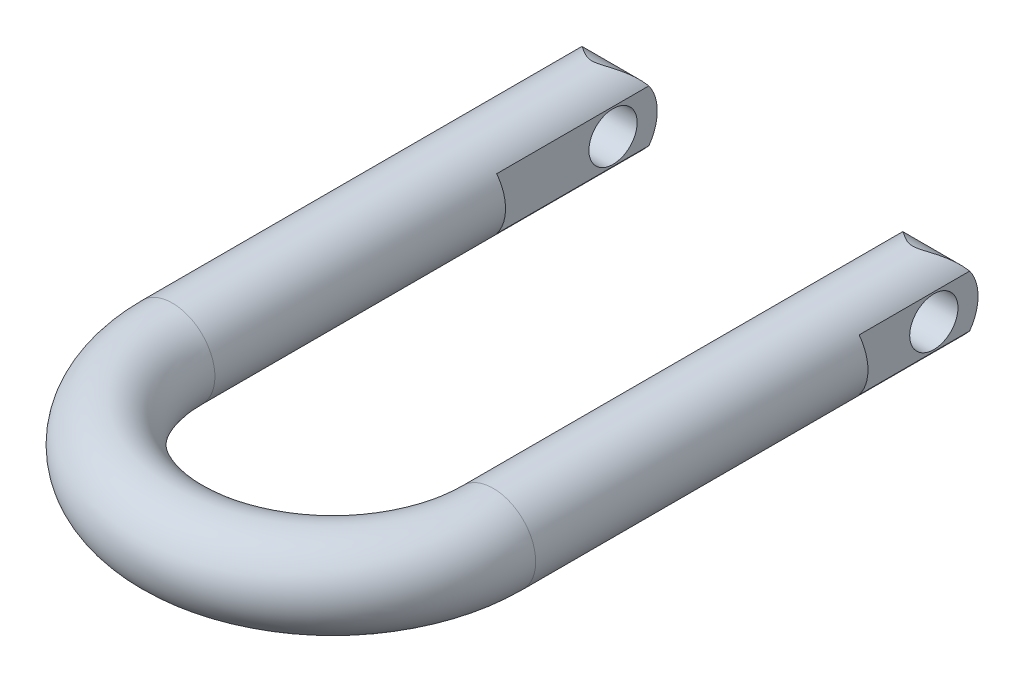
ISO-10303-21;
HEADER;
FILE_DESCRIPTION(('STEP AP214'),'2;1');
FILE_NAME('part.step','',(''),(''),'','','');
FILE_SCHEMA(('AUTOMOTIVE_DESIGN { 1 0 10303 214 1 1 1 1 }'));
ENDSEC;
DATA;
#1=APPLICATION_CONTEXT('core data for automotive mechanical design processes');
#2=APPLICATION_PROTOCOL_DEFINITION('international standard','automotive_design',2000,#1);
#3=PRODUCT_CONTEXT('',#1,'mechanical');
#4=PRODUCT('Part','Part','',(#3));
#5=PRODUCT_RELATED_PRODUCT_CATEGORY('part','',(#4));
#6=PRODUCT_DEFINITION_FORMATION('','',#4);
#7=PRODUCT_DEFINITION_CONTEXT('part definition',#1,'design');
#8=PRODUCT_DEFINITION('design','',#6,#7);
#9=PRODUCT_DEFINITION_SHAPE('','',#8);
#10=(LENGTH_UNIT() NAMED_UNIT(*) SI_UNIT(.MILLI.,.METRE.));
#11=(NAMED_UNIT(*) PLANE_ANGLE_UNIT() SI_UNIT($,.RADIAN.));
#12=(NAMED_UNIT(*) SI_UNIT($,.STERADIAN.) SOLID_ANGLE_UNIT());
#13=UNCERTAINTY_MEASURE_WITH_UNIT(LENGTH_MEASURE(1.E-05),#10,'distance_accuracy_value','');
#14=(GEOMETRIC_REPRESENTATION_CONTEXT(3) GLOBAL_UNCERTAINTY_ASSIGNED_CONTEXT((#13)) GLOBAL_UNIT_ASSIGNED_CONTEXT((#10,
#11,#12)) REPRESENTATION_CONTEXT('',''));
#15=CARTESIAN_POINT('',(0.,0.,0.));
#16=DIRECTION('',(0.,0.,1.));
#17=DIRECTION('',(1.,0.,0.));
#18=AXIS2_PLACEMENT_3D('',#15,#16,#17);
#19=CARTESIAN_POINT('',(-59.2,-30.,22.8));
#20=DIRECTION('',(1.,0.,0.));
#21=DIRECTION('',(0.,1.,0.));
#22=AXIS2_PLACEMENT_3D('',#19,#20,#21);
#23=PLANE('',#22);
#24=DIRECTION('',(0.,0.,-1.));
#25=VECTOR('',#24,1.);
#26=CARTESIAN_POINT('',(-59.2,7.91454357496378,124.2));
#27=LINE('',#26,#25);
#28=CARTESIAN_POINT('',(-59.2,7.91454357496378,-10.9366356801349));
#29=VERTEX_POINT('',#28);
#30=CARTESIAN_POINT('',(-59.2,7.91454357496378,22.8));
#31=VERTEX_POINT('',#30);
#32=EDGE_CURVE('E96',#29,#31,#27,.F.);
#33=ORIENTED_EDGE('',*,*,#32,.F.);
#34=CARTESIAN_POINT('',(-59.2,0.,0.));
#35=DIRECTION('',(1.,0.,0.));
#36=DIRECTION('',(0.,1.,0.));
#37=AXIS2_PLACEMENT_3D('',#34,#35,#36);
#38=CIRCLE('',#37,13.5);
#39=CARTESIAN_POINT('',(-59.2,-7.91454357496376,-10.9366356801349));
#40=VERTEX_POINT('',#39);
#41=EDGE_CURVE('E100',#40,#29,#38,.T.);
#42=ORIENTED_EDGE('',*,*,#41,.F.);
#43=DIRECTION('',(0.,0.,-1.));
#44=VECTOR('',#43,1.);
#45=CARTESIAN_POINT('',(-59.2,-7.91454357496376,124.2));
#46=LINE('',#45,#44);
#47=CARTESIAN_POINT('',(-59.2,-7.91454357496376,22.8));
#48=VERTEX_POINT('',#47);
#49=EDGE_CURVE('E85',#48,#40,#46,.T.);
#50=ORIENTED_EDGE('',*,*,#49,.F.);
#51=DIRECTION('',(0.,1.,0.));
#52=VECTOR('',#51,1.);
#53=CARTESIAN_POINT('',(-59.2,-30.,22.8));
#54=LINE('',#53,#52);
#55=EDGE_CURVE('E122',#48,#31,#54,.T.);
#56=ORIENTED_EDGE('',*,*,#55,.T.);
#57=EDGE_LOOP('',(#33,#42,#50,#56));
#58=FACE_BOUND('',#57,.T.);
#59=CARTESIAN_POINT('',(-59.2,0.,0.));
#60=DIRECTION('',(1.,0.,0.));
#61=DIRECTION('',(0.,0.,-1.));
#62=AXIS2_PLACEMENT_3D('',#59,#60,#61);
#63=CIRCLE('',#62,7.365);
#64=CARTESIAN_POINT('',(-59.2,0.,-7.365));
#65=VERTEX_POINT('',#64);
#66=EDGE_CURVE('E104',#65,#65,#63,.T.);
#67=ORIENTED_EDGE('',*,*,#66,.T.);
#68=EDGE_LOOP('',(#67));
#69=FACE_BOUND('',#68,.T.);
#70=ADVANCED_FACE('F14',(#58,#69),#23,.F.);
#71=CARTESIAN_POINT('',(-38.7,20.,35.5));
#72=DIRECTION('',(1.,0.,0.));
#73=DIRECTION('',(0.,1.,0.));
#74=AXIS2_PLACEMENT_3D('',#71,#72,#73);
#75=PLANE('',#74);
#76=CARTESIAN_POINT('',(-38.7,0.,0.));
#77=DIRECTION('',(1.,0.,0.));
#78=DIRECTION('',(0.,1.,0.));
#79=AXIS2_PLACEMENT_3D('',#76,#77,#78);
#80=CIRCLE('',#79,13.5);
#81=CARTESIAN_POINT('',(-38.7,7.91454357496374,-10.9366356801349));
#82=VERTEX_POINT('',#81);
#83=CARTESIAN_POINT('',(-38.7,-7.91454357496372,-10.9366356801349));
#84=VERTEX_POINT('',#83);
#85=EDGE_CURVE('E35',#82,#84,#80,.F.);
#86=ORIENTED_EDGE('',*,*,#85,.F.);
#87=DIRECTION('',(0.,0.,-1.));
#88=VECTOR('',#87,1.);
#89=CARTESIAN_POINT('',(-38.7,7.91454357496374,124.2));
#90=LINE('',#89,#88);
#91=CARTESIAN_POINT('',(-38.7,7.91454357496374,35.5));
#92=VERTEX_POINT('',#91);
#93=EDGE_CURVE('E118',#82,#92,#90,.F.);
#94=ORIENTED_EDGE('',*,*,#93,.T.);
#95=DIRECTION('',(0.,1.,0.));
#96=VECTOR('',#95,1.);
#97=CARTESIAN_POINT('',(-38.7,-20.,35.5));
#98=LINE('',#97,#96);
#99=CARTESIAN_POINT('',(-38.7,-7.91454357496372,35.5));
#100=VERTEX_POINT('',#99);
#101=EDGE_CURVE('E115',#100,#92,#98,.T.);
#102=ORIENTED_EDGE('',*,*,#101,.F.);
#103=DIRECTION('',(0.,0.,-1.));
#104=VECTOR('',#103,1.);
#105=CARTESIAN_POINT('',(-38.7,-7.91454357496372,124.2));
#106=LINE('',#105,#104);
#107=EDGE_CURVE('E120',#100,#84,#106,.T.);
#108=ORIENTED_EDGE('',*,*,#107,.T.);
#109=EDGE_LOOP('',(#86,#94,#102,#108));
#110=FACE_BOUND('',#109,.T.);
#111=CARTESIAN_POINT('',(-38.7,0.,0.));
#112=DIRECTION('',(1.,0.,0.));
#113=DIRECTION('',(0.,1.,0.));
#114=AXIS2_PLACEMENT_3D('',#111,#112,#113);
#115=CIRCLE('',#114,7.365);
#116=CARTESIAN_POINT('',(-38.7,7.365,0.));
#117=VERTEX_POINT('',#116);
#118=EDGE_CURVE('E106',#117,#117,#115,.T.);
#119=ORIENTED_EDGE('',*,*,#118,.F.);
#120=EDGE_LOOP('',(#119));
#121=FACE_BOUND('',#120,.T.);
#122=ADVANCED_FACE('F164',(#110,#121),#75,.T.);
#123=CARTESIAN_POINT('',(-48.95,0.,124.2));
#124=DIRECTION('',(0.,0.,-1.));
#125=DIRECTION('',(1.,0.,0.));
#126=AXIS2_PLACEMENT_3D('',#123,#124,#125);
#127=CYLINDRICAL_SURFACE('',#126,12.95);
#128=CARTESIAN_POINT('',(-48.95,0.,124.2));
#129=DIRECTION('',(0.,0.,1.));
#130=DIRECTION('',(0.,-1.,0.));
#131=AXIS2_PLACEMENT_3D('',#128,#129,#130);
#132=CIRCLE('',#131,12.95);
#133=CARTESIAN_POINT('',(-61.9,0.,124.2));
#134=VERTEX_POINT('',#133);
#135=EDGE_CURVE('E298',#134,#134,#132,.T.);
#136=ORIENTED_EDGE('',*,*,#135,.F.);
#137=EDGE_LOOP('',(#136));
#138=FACE_BOUND('',#137,.T.);
#139=CARTESIAN_POINT('',(-36.,0.,-13.5));
#140=CARTESIAN_POINT('',(-36.0000025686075,0.293199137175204,-13.4999974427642));
#141=CARTESIAN_POINT('',(-36.0099780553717,0.586445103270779,-13.4904275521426));
#142=CARTESIAN_POINT('',(-36.0496814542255,1.1704850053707,-13.4523487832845));
#143=CARTESIAN_POINT('',(-36.0794202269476,1.46127750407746,-13.4238294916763));
#144=CARTESIAN_POINT('',(-36.1581150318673,2.03842301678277,-13.3483967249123));
#145=CARTESIAN_POINT('',(-36.2071094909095,2.32476595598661,-13.3014464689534));
#146=CARTESIAN_POINT('',(-36.3233406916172,2.89020691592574,-13.1901381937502));
#147=CARTESIAN_POINT('',(-36.3905753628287,3.16930575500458,-13.1257821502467));
#148=CARTESIAN_POINT('',(-36.5415446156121,3.71654723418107,-12.9814013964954));
#149=CARTESIAN_POINT('',(-36.625158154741,3.98475379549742,-12.9014916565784));
#150=CARTESIAN_POINT('',(-36.807844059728,4.5108932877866,-12.7270857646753));
#151=CARTESIAN_POINT('',(-36.9069165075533,4.76882616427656,-12.6325895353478));
#152=CARTESIAN_POINT('',(-37.2252031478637,5.52546055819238,-12.3294033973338));
#153=CARTESIAN_POINT('',(-37.4656171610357,6.00745842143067,-12.1008908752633));
#154=CARTESIAN_POINT('',(-38.1000775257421,7.10877519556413,-11.5001649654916));
#155=CARTESIAN_POINT('',(-38.516769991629,7.70379205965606,-11.1073764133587));
#156=CARTESIAN_POINT('',(-39.1922448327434,8.52141662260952,-10.4763971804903));
#157=CARTESIAN_POINT('',(-39.4262930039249,8.78189008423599,-10.2586593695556));
#158=CARTESIAN_POINT('',(-39.9092753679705,9.27833910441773,-9.81191913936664));
#159=CARTESIAN_POINT('',(-40.1582085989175,9.51431624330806,-9.58291744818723));
#160=CARTESIAN_POINT('',(-40.7538609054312,10.0364632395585,-9.03907336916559));
#161=CARTESIAN_POINT('',(-41.105661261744,10.3133732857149,-8.72091959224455));
#162=CARTESIAN_POINT('',(-41.8303256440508,10.8263597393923,-8.07526114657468));
#163=CARTESIAN_POINT('',(-42.2032039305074,11.0624080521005,-7.74775022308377));
#164=CARTESIAN_POINT('',(-42.7775234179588,11.3864466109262,-7.25516783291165));
#165=CARTESIAN_POINT('',(-42.9713325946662,11.4893965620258,-7.09086172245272));
#166=CARTESIAN_POINT('',(-43.3643066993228,11.6854941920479,-6.7628178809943));
#167=CARTESIAN_POINT('',(-43.5634710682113,11.7786428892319,-6.59908009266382));
#168=CARTESIAN_POINT('',(-43.9674407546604,11.9551307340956,-6.2736814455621));
#169=CARTESIAN_POINT('',(-44.1722411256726,12.0384781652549,-6.11201893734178));
#170=CARTESIAN_POINT('',(-44.5884037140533,12.1954275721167,-5.79251015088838));
#171=CARTESIAN_POINT('',(-44.7997643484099,12.2690318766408,-5.63466296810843));
#172=CARTESIAN_POINT('',(-45.1612774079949,12.3843293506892,-5.37509175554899));
#173=CARTESIAN_POINT('',(-45.3093165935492,12.4286853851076,-5.27160616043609));
#174=CARTESIAN_POINT('',(-45.6095950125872,12.5127340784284,-5.06887715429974));
#175=CARTESIAN_POINT('',(-45.7618344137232,12.5524265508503,-4.96963391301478));
#176=CARTESIAN_POINT('',(-46.071116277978,12.6269481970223,-4.77711361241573));
#177=CARTESIAN_POINT('',(-46.2281559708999,12.6617801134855,-4.68383320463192));
#178=CARTESIAN_POINT('',(-46.5478629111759,12.7263040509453,-4.50557279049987));
#179=CARTESIAN_POINT('',(-46.710528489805,12.7559975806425,-4.42059035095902));
#180=CARTESIAN_POINT('',(-47.1060547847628,12.820161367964,-4.23163825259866));
#181=CARTESIAN_POINT('',(-47.3419187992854,12.8520987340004,-4.13287958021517));
#182=CARTESIAN_POINT('',(-47.826418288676,12.9034447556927,-3.96971126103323));
#183=CARTESIAN_POINT('',(-48.0750109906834,12.922892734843,-3.9051939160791));
#184=CARTESIAN_POINT('',(-48.5400710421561,12.9452478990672,-3.83039349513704));
#185=CARTESIAN_POINT('',(-48.7552395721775,12.9503198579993,-3.81303212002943));
#186=CARTESIAN_POINT('',(-49.185212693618,12.9496485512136,-3.81531215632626));
#187=CARTESIAN_POINT('',(-49.4000174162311,12.943910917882,-3.83493429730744));
#188=CARTESIAN_POINT('',(-49.8846621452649,12.9191220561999,-3.91771502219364));
#189=CARTESIAN_POINT('',(-50.1523973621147,12.8966924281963,-3.99184892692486));
#190=CARTESIAN_POINT('',(-50.5424414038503,12.8523939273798,-4.13138570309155));
#191=CARTESIAN_POINT('',(-50.6708828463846,12.8357887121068,-4.18281008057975));
#192=CARTESIAN_POINT('',(-50.9240373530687,12.7992959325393,-4.29318161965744));
#193=CARTESIAN_POINT('',(-51.0487507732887,12.7794086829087,-4.35212805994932));
#194=CARTESIAN_POINT('',(-51.3381987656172,12.7290068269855,-4.49780208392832));
#195=CARTESIAN_POINT('',(-51.5014666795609,12.6972227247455,-4.58697565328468));
#196=CARTESIAN_POINT('',(-51.8224827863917,12.6284711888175,-4.77300446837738));
#197=CARTESIAN_POINT('',(-51.9802283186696,12.5915012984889,-4.86986334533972));
#198=CARTESIAN_POINT('',(-52.2911937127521,12.5125816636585,-5.06920193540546));
#199=CARTESIAN_POINT('',(-52.4444059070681,12.4706240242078,-5.17169041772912));
#200=CARTESIAN_POINT('',(-52.7467295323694,12.3819280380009,-5.38059161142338));
#201=CARTESIAN_POINT('',(-52.8958402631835,12.3351888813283,-5.48700498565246));
#202=CARTESIAN_POINT('',(-53.3391653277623,12.1875023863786,-5.81130116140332));
#203=CARTESIAN_POINT('',(-53.6280022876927,12.0794381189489,-6.03333236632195));
#204=CARTESIAN_POINT('',(-54.1938035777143,11.8447707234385,-6.48194753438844));
#205=CARTESIAN_POINT('',(-54.4707777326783,11.7181833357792,-6.70852749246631));
#206=CARTESIAN_POINT('',(-55.1267255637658,11.3901318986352,-7.25634261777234));
#207=CARTESIAN_POINT('',(-55.5006585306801,11.1793177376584,-7.57807881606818));
#208=CARTESIAN_POINT('',(-56.2293451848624,10.7191067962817,-8.21619240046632));
#209=CARTESIAN_POINT('',(-56.5840872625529,10.4696870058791,-8.53256646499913));
#210=CARTESIAN_POINT('',(-57.2715078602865,9.93200378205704,-9.15276686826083));
#211=CARTESIAN_POINT('',(-57.6042643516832,9.64388998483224,-9.45663592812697));
#212=CARTESIAN_POINT('',(-58.2460445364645,9.02684677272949,-10.0473018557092));
#213=CARTESIAN_POINT('',(-58.5550839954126,8.69794485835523,-10.3341100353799));
#214=CARTESIAN_POINT('',(-59.0423131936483,8.1201388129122,-10.7887696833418));
#215=CARTESIAN_POINT('',(-59.2286040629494,7.88324209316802,-10.9632761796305));
#216=CARTESIAN_POINT('',(-59.5876514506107,7.39158213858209,-11.3005901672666));
#217=CARTESIAN_POINT('',(-59.7604119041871,7.13682413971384,-11.4634010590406));
#218=CARTESIAN_POINT('',(-60.0905062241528,6.60970972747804,-11.7752048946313));
#219=CARTESIAN_POINT('',(-60.2478496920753,6.33736444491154,-11.9242064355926));
#220=CARTESIAN_POINT('',(-60.5451589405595,5.77544512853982,-12.2062689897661));
#221=CARTESIAN_POINT('',(-60.6851274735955,5.48587383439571,-12.3393325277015));
#222=CARTESIAN_POINT('',(-60.9235909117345,4.94051776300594,-12.5663552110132));
#223=CARTESIAN_POINT('',(-61.0251035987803,4.68722186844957,-12.6631289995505));
#224=CARTESIAN_POINT('',(-61.2132109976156,4.17034227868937,-12.8426263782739));
#225=CARTESIAN_POINT('',(-61.2998088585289,3.90676076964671,-12.9253529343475));
#226=CARTESIAN_POINT('',(-61.4567709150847,3.37063175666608,-13.0754077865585));
#227=CARTESIAN_POINT('',(-61.5271417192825,3.09808795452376,-13.142742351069));
#228=CARTESIAN_POINT('',(-61.6505042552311,2.54554686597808,-13.2608442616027));
#229=CARTESIAN_POINT('',(-61.7034958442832,2.26554951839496,-13.3116114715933));
#230=CARTESIAN_POINT('',(-61.7913532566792,1.69850168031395,-13.3958088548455));
#231=CARTESIAN_POINT('',(-61.826116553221,1.41142060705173,-13.4291409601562));
#232=CARTESIAN_POINT('',(-61.8763635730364,0.834023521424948,-13.4773263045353));
#233=CARTESIAN_POINT('',(-61.8918472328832,0.543707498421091,-13.4921794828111));
#234=CARTESIAN_POINT('',(-61.9032077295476,-0.0376161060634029,-13.503076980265));
#235=CARTESIAN_POINT('',(-61.8990876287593,-0.328623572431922,-13.499124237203));
#236=CARTESIAN_POINT('',(-61.871333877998,-0.908829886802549,-13.47250361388));
#237=CARTESIAN_POINT('',(-61.8477013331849,-1.19802883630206,-13.4498367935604));
#238=CARTESIAN_POINT('',(-61.7843973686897,-1.74641715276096,-13.3891442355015));
#239=CARTESIAN_POINT('',(-61.7463548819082,-2.00597135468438,-13.3526786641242));
#240=CARTESIAN_POINT('',(-61.6551436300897,-2.51990686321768,-13.2652932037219));
#241=CARTESIAN_POINT('',(-61.6019759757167,-2.77428854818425,-13.2143743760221));
#242=CARTESIAN_POINT('',(-61.4813275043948,-3.27643255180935,-13.0989069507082));
#243=CARTESIAN_POINT('',(-61.4138479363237,-3.52419544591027,-13.0343595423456));
#244=CARTESIAN_POINT('',(-61.2654829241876,-4.01203452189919,-12.8925615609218));
#245=CARTESIAN_POINT('',(-61.1845922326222,-4.25210765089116,-12.8153060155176));
#246=CARTESIAN_POINT('',(-61.0044197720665,-4.7397883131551,-12.6434076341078));
#247=CARTESIAN_POINT('',(-60.9042553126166,-4.98677687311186,-12.5479339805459));
#248=CARTESIAN_POINT('',(-60.6910015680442,-5.47002959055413,-12.344940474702));
#249=CARTESIAN_POINT('',(-60.5779072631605,-5.7062895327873,-12.2374159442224));
#250=CARTESIAN_POINT('',(-60.2210183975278,-6.39810055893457,-11.8986432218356));
#251=CARTESIAN_POINT('',(-59.9595599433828,-6.83683652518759,-11.6511404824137));
#252=CARTESIAN_POINT('',(-59.4593182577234,-7.57702324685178,-11.1797968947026));
#253=CARTESIAN_POINT('',(-59.2278006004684,-7.88767826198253,-10.9623601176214));
#254=CARTESIAN_POINT('',(-58.7447514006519,-8.48005390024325,-10.5108171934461));
#255=CARTESIAN_POINT('',(-58.4932170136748,-8.7617703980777,-10.2767086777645));
#256=CARTESIAN_POINT('',(-57.972292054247,-9.29735124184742,-9.79486641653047));
#257=CARTESIAN_POINT('',(-57.7028561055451,-9.55114011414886,-9.54709834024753));
#258=CARTESIAN_POINT('',(-57.1488328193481,-10.0307454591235,-9.04187036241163));
#259=CARTESIAN_POINT('',(-56.8642483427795,-10.2565671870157,-8.78441229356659));
#260=CARTESIAN_POINT('',(-56.273243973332,-10.6869026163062,-8.25586806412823));
#261=CARTESIAN_POINT('',(-55.9664399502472,-10.890665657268,-7.98460174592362));
#262=CARTESIAN_POINT('',(-55.3386025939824,-11.2704452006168,-7.43892462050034));
#263=CARTESIAN_POINT('',(-55.0175641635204,-11.446451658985,-7.16451271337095));
#264=CARTESIAN_POINT('',(-54.3612484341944,-11.7709310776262,-6.61783615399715));
#265=CARTESIAN_POINT('',(-54.0260007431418,-11.9194581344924,-6.34556831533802));
#266=CARTESIAN_POINT('',(-53.5101312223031,-12.1219509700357,-5.94397771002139));
#267=CARTESIAN_POINT('',(-53.3360554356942,-12.1860515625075,-5.81128305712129));
#268=CARTESIAN_POINT('',(-52.9828756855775,-12.3074495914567,-5.54954443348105));
#269=CARTESIAN_POINT('',(-52.8037726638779,-12.364748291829,-5.4204997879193));
#270=CARTESIAN_POINT('',(-52.4800699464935,-12.4604536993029,-5.19600930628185));
#271=CARTESIAN_POINT('',(-52.33663838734,-12.5002303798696,-5.09946487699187));
#272=CARTESIAN_POINT('',(-52.0456167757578,-12.5754623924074,-4.91101123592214));
#273=CARTESIAN_POINT('',(-51.8980264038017,-12.6109173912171,-4.81910238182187));
#274=CARTESIAN_POINT('',(-51.5980819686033,-12.677292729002,-4.64168135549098));
#275=CARTESIAN_POINT('',(-51.4457295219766,-12.7082145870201,-4.55616704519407));
#276=CARTESIAN_POINT('',(-51.1355636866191,-12.7652126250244,-4.39394502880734));
#277=CARTESIAN_POINT('',(-50.9777521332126,-12.7912904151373,-4.31723439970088));
#278=CARTESIAN_POINT('',(-50.5943137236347,-12.8471543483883,-4.14863312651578));
#279=CARTESIAN_POINT('',(-50.3658510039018,-12.8745390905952,-4.06217143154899));
#280=CARTESIAN_POINT('',(-49.8977648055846,-12.9173845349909,-3.92385848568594));
#281=CARTESIAN_POINT('',(-49.6581844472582,-12.9328877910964,-3.87188380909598));
#282=CARTESIAN_POINT('',(-49.2927917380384,-12.946051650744,-3.82752192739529));
#283=CARTESIAN_POINT('',(-49.1691053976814,-12.9487402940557,-3.81839159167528));
#284=CARTESIAN_POINT('',(-48.9213874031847,-12.9505591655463,-3.81222356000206));
#285=CARTESIAN_POINT('',(-48.7973557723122,-12.9496896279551,-3.81518506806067));
#286=CARTESIAN_POINT('',(-48.5501210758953,-12.944416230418,-3.83303575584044));
#287=CARTESIAN_POINT('',(-48.426918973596,-12.9400088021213,-3.84793697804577));
#288=CARTESIAN_POINT('',(-48.1824751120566,-12.9278155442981,-3.88870723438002));
#289=CARTESIAN_POINT('',(-48.0612348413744,-12.9200272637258,-3.91458422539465));
#290=CARTESIAN_POINT('',(-47.6328963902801,-12.8865565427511,-4.0240948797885));
#291=CARTESIAN_POINT('',(-47.3332480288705,-12.8519911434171,-4.13457384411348));
#292=CARTESIAN_POINT('',(-46.8989494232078,-12.7873931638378,-4.32866446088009));
#293=CARTESIAN_POINT('',(-46.7563274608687,-12.7636494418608,-4.39832956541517));
#294=CARTESIAN_POINT('',(-46.4755377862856,-12.7121924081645,-4.54490710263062));
#295=CARTESIAN_POINT('',(-46.3373694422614,-12.6844796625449,-4.62181850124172));
#296=CARTESIAN_POINT('',(-46.0054060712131,-12.6123783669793,-4.81588992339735));
#297=CARTESIAN_POINT('',(-45.8137474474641,-12.5660016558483,-4.93592629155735));
#298=CARTESIAN_POINT('',(-45.4371619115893,-12.4659697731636,-5.18338230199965));
#299=CARTESIAN_POINT('',(-45.2522379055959,-12.4123115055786,-5.31080507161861));
#300=CARTESIAN_POINT('',(-44.8878171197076,-12.2978737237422,-5.57068131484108));
#301=CARTESIAN_POINT('',(-44.7083285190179,-12.2370840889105,-5.70314175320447));
#302=CARTESIAN_POINT('',(-44.3542377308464,-12.1085472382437,-5.97119914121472));
#303=CARTESIAN_POINT('',(-44.1796362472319,-12.0407990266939,-6.10679653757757));
#304=CARTESIAN_POINT('',(-43.6614878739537,-11.8268432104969,-6.51696605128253));
#305=CARTESIAN_POINT('',(-43.3244010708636,-11.670179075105,-6.7943255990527));
#306=CARTESIAN_POINT('',(-42.6654819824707,-11.3289320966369,-7.34925545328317));
#307=CARTESIAN_POINT('',(-42.3436376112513,-11.1443718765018,-7.62682540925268));
#308=CARTESIAN_POINT('',(-41.6986099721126,-10.7365112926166,-8.19174734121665));
#309=CARTESIAN_POINT('',(-41.3761745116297,-10.5117286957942,-8.4788885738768));
#310=CARTESIAN_POINT('',(-40.7481322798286,-10.0293886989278,-9.04431022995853));
#311=CARTESIAN_POINT('',(-40.4425314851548,-9.77181976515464,-9.3225874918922));
#312=CARTESIAN_POINT('',(-39.8512738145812,-9.22375628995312,-9.86511928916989));
#313=CARTESIAN_POINT('',(-39.5655594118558,-8.9333636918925,-10.1294136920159));
#314=CARTESIAN_POINT('',(-39.0162560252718,-8.31823754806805,-10.6403300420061));
#315=CARTESIAN_POINT('',(-38.752655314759,-7.9935224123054,-10.88696134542));
#316=CARTESIAN_POINT('',(-38.3315774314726,-7.4185548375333,-11.2825085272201));
#317=CARTESIAN_POINT('',(-38.1670704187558,-7.1775906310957,-11.4374988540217));
#318=CARTESIAN_POINT('',(-37.8517562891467,-6.67969104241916,-11.7352382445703));
#319=CARTESIAN_POINT('',(-37.7009457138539,-6.42275971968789,-11.8779903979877));
#320=CARTESIAN_POINT('',(-37.4147750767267,-5.89335252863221,-12.1493560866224));
#321=CARTESIAN_POINT('',(-37.2794112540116,-5.62088046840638,-12.2779730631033));
#322=CARTESIAN_POINT('',(-37.0260022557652,-5.06113658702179,-12.5190935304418));
#323=CARTESIAN_POINT('',(-36.9079541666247,-4.77386726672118,-12.6315997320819));
#324=CARTESIAN_POINT('',(-36.7073120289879,-4.22968102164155,-12.8230319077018));
#325=CARTESIAN_POINT('',(-36.6220560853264,-3.97462530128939,-12.904463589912));
#326=CARTESIAN_POINT('',(-36.4667039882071,-3.45587759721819,-13.0529559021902));
#327=CARTESIAN_POINT('',(-36.3966048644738,-3.19218731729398,-13.1200193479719));
#328=CARTESIAN_POINT('',(-36.2727825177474,-2.65812782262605,-13.23854307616));
#329=CARTESIAN_POINT('',(-36.2190263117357,-2.38777326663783,-13.2900347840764));
#330=CARTESIAN_POINT('',(-36.1286483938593,-1.84172695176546,-13.3766359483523));
#331=CARTESIAN_POINT('',(-36.0920184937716,-1.56603780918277,-13.4117532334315));
#332=CARTESIAN_POINT('',(-36.0429341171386,-1.07525848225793,-13.4588192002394));
#333=CARTESIAN_POINT('',(-36.0268528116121,-0.860852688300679,-13.4742429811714));
#334=CARTESIAN_POINT('',(-36.0053837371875,-0.430973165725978,-13.4948353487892));
#335=CARTESIAN_POINT('',(-35.9999981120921,-0.215499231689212,-13.5000018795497));
#336=CARTESIAN_POINT('',(-36.,0.,-13.5));
#337=B_SPLINE_CURVE_WITH_KNOTS('',3,(#139,#140,#141,#142,#143,#144,#145,#146,#147,#148,#149,
#150,#151,#152,#153,#154,#155,#156,#157,#158,#159,#160,#161,#162,#163,#164,#165,#166,#167,#168,
#169,#170,#171,#172,#173,#174,#175,#176,#177,#178,#179,#180,#181,#182,#183,#184,#185,#186,#187,
#188,#189,#190,#191,#192,#193,#194,#195,#196,#197,#198,#199,#200,#201,#202,#203,#204,#205,#206,
#207,#208,#209,#210,#211,#212,#213,#214,#215,#216,#217,#218,#219,#220,#221,#222,#223,#224,#225,
#226,#227,#228,#229,#230,#231,#232,#233,#234,#235,#236,#237,#238,#239,#240,#241,#242,#243,#244,
#245,#246,#247,#248,#249,#250,#251,#252,#253,#254,#255,#256,#257,#258,#259,#260,#261,#262,#263,
#264,#265,#266,#267,#268,#269,#270,#271,#272,#273,#274,#275,#276,#277,#278,#279,#280,#281,#282,
#283,#284,#285,#286,#287,#288,#289,#290,#291,#292,#293,#294,#295,#296,#297,#298,#299,#300,#301,
#302,#303,#304,#305,#306,#307,#308,#309,#310,#311,#312,#313,#314,#315,#316,#317,#318,#319,#320,
#321,#322,#323,#324,#325,#326,#327,#328,#329,#330,#331,#332,#333,#334,#335,#336),.UNSPECIFIED.,
.T.,.F.,(4,2,2,2,2,2,2,2,2,2,2,2,2,2,2,2,2,2,2,2,2,2,2,2,2,2,2,2,2,2,2,2,2,2,2,2,2,2,2,2,2,2,2,
2,2,2,2,2,2,2,2,2,2,2,2,2,2,2,2,2,2,2,2,2,2,2,2,2,2,2,2,2,2,2,2,2,2,2,2,2,2,2,2,2,2,2,2,2,2,2,2,
2,2,2,2,2,2,2,4),(0.,0.87935637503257,1.75919638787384,2.64080120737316,3.5223059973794,
4.3975266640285,5.27275197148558,7.02173493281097,9.48494296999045,10.7211666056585,
11.9573104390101,13.6028475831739,15.2495116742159,16.0717741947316,16.893951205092,
17.7154282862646,18.5367086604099,19.0945537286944,19.652421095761,20.2099723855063,
20.7673596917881,21.5384329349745,22.3070663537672,22.9515143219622,23.595626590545,
24.4265309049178,24.8443980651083,25.2622251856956,25.8280112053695,26.3940661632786,
26.9610293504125,27.5280887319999,28.6672386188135,29.8054260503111,31.4129954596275,
33.021526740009,34.6240076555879,36.2254139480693,37.2693663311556,38.3130139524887,
39.3560074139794,40.3988354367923,41.2665972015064,42.1341755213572,43.001399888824,
43.8686313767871,44.7406897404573,45.6127509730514,46.484675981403,47.3565516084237,
48.150215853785,48.9438218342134,49.7373585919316,50.531206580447,51.3797014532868,
52.2285268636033,53.9256622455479,55.2568785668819,56.588284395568,57.9232042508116,
59.2578728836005,60.6290037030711,62.0006295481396,63.3695257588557,64.0536174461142,
64.7375818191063,65.2696914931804,65.8018421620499,66.3338140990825,66.8656088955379,
67.6009625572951,68.3336700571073,68.7052492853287,69.0768040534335,69.4487340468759,
69.8209341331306,70.7782545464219,71.2596678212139,71.7410125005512,72.4331428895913,
73.1255684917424,73.8189889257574,74.5125087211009,75.9026283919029,77.2916267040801,
78.7505300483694,80.2099480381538,81.6649518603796,83.119179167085,84.1095244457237,
85.099618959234,86.08947189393,87.0791580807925,87.921272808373,88.763222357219,
89.6034612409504,90.4432979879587,91.0894890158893,91.735809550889),.UNSPECIFIED.);
#338=EDGE_CURVE('E9',#82,#29,#337,.T.);
#339=ORIENTED_EDGE('',*,*,#338,.T.);
#340=ORIENTED_EDGE('',*,*,#32,.T.);
#341=CARTESIAN_POINT('',(-48.95,0.,22.8));
#342=DIRECTION('',(0.,0.,1.));
#343=DIRECTION('',(0.,-1.,0.));
#344=AXIS2_PLACEMENT_3D('',#341,#342,#343);
#345=CIRCLE('',#344,12.95);
#346=EDGE_CURVE('E90',#31,#48,#345,.T.);
#347=ORIENTED_EDGE('',*,*,#346,.T.);
#348=ORIENTED_EDGE('',*,*,#49,.T.);
#349=EDGE_CURVE('E19',#40,#84,#337,.T.);
#350=ORIENTED_EDGE('',*,*,#349,.T.);
#351=ORIENTED_EDGE('',*,*,#107,.F.);
#352=CARTESIAN_POINT('',(-48.95,0.,35.5));
#353=DIRECTION('',(0.,0.,-1.));
#354=DIRECTION('',(0.,1.,0.));
#355=AXIS2_PLACEMENT_3D('',#352,#353,#354);
#356=CIRCLE('',#355,12.95);
#357=EDGE_CURVE('E102',#92,#100,#356,.T.);
#358=ORIENTED_EDGE('',*,*,#357,.F.);
#359=ORIENTED_EDGE('',*,*,#93,.F.);
#360=EDGE_LOOP('',(#339,#340,#347,#348,#350,#351,#358,#359));
#361=FACE_BOUND('',#360,.T.);
#362=ADVANCED_FACE('F86',(#138,#361),#127,.T.);
#363=CARTESIAN_POINT('',(48.95,0.,124.2));
#364=DIRECTION('',(0.,0.,-1.));
#365=DIRECTION('',(1.,0.,0.));
#366=AXIS2_PLACEMENT_3D('',#363,#364,#365);
#367=CYLINDRICAL_SURFACE('',#366,12.95);
#368=CARTESIAN_POINT('',(48.95,0.,124.2));
#369=DIRECTION('',(0.,0.,-1.));
#370=DIRECTION('',(0.,-1.,0.));
#371=AXIS2_PLACEMENT_3D('',#368,#369,#370);
#372=CIRCLE('',#371,12.95);
#373=CARTESIAN_POINT('',(61.9,0.,124.2));
#374=VERTEX_POINT('',#373);
#375=EDGE_CURVE('E282',#374,#374,#372,.T.);
#376=ORIENTED_EDGE('',*,*,#375,.T.);
#377=EDGE_LOOP('',(#376));
#378=FACE_BOUND('',#377,.T.);
#379=DIRECTION('',(0.,0.,-1.));
#380=VECTOR('',#379,1.);
#381=CARTESIAN_POINT('',(59.2,7.91454357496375,124.2));
#382=LINE('',#381,#380);
#383=CARTESIAN_POINT('',(59.2,7.91454357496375,22.8));
#384=VERTEX_POINT('',#383);
#385=CARTESIAN_POINT('',(59.2,7.91454357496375,-10.9366356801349));
#386=VERTEX_POINT('',#385);
#387=EDGE_CURVE('E284',#384,#386,#382,.T.);
#388=ORIENTED_EDGE('',*,*,#387,.T.);
#389=CARTESIAN_POINT('',(61.9,0.,-13.5));
#390=CARTESIAN_POINT('',(61.8999974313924,0.293199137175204,-13.4999974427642));
#391=CARTESIAN_POINT('',(61.8900219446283,0.58644510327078,-13.4904275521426));
#392=CARTESIAN_POINT('',(61.8503185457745,1.1704850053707,-13.4523487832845));
#393=CARTESIAN_POINT('',(61.8205797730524,1.46127750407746,-13.4238294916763));
#394=CARTESIAN_POINT('',(61.7418849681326,2.03842301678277,-13.3483967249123));
#395=CARTESIAN_POINT('',(61.6928905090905,2.32476595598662,-13.3014464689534));
#396=CARTESIAN_POINT('',(61.5766593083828,2.89020691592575,-13.1901381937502));
#397=CARTESIAN_POINT('',(61.5094246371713,3.16930575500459,-13.1257821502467));
#398=CARTESIAN_POINT('',(61.3584553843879,3.71654723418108,-12.9814013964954));
#399=CARTESIAN_POINT('',(61.2748418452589,3.98475379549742,-12.9014916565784));
#400=CARTESIAN_POINT('',(61.0921559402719,4.5108932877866,-12.7270857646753));
#401=CARTESIAN_POINT('',(60.9930834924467,4.76882616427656,-12.6325895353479));
#402=CARTESIAN_POINT('',(60.6747968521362,5.52546055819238,-12.3294033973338));
#403=CARTESIAN_POINT('',(60.4343828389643,6.00745842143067,-12.1008908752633));
#404=CARTESIAN_POINT('',(59.7999224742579,7.10877519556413,-11.5001649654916));
#405=CARTESIAN_POINT('',(59.383230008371,7.70379205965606,-11.1073764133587));
#406=CARTESIAN_POINT('',(58.7077551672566,8.52141662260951,-10.4763971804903));
#407=CARTESIAN_POINT('',(58.4737069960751,8.78189008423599,-10.2586593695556));
#408=CARTESIAN_POINT('',(57.9907246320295,9.27833910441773,-9.81191913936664));
#409=CARTESIAN_POINT('',(57.7417914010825,9.51431624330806,-9.58291744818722));
#410=CARTESIAN_POINT('',(57.1461390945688,10.0364632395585,-9.03907336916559));
#411=CARTESIAN_POINT('',(56.794338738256,10.3133732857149,-8.72091959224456));
#412=CARTESIAN_POINT('',(56.0696743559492,10.8263597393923,-8.07526114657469));
#413=CARTESIAN_POINT('',(55.6967960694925,11.0624080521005,-7.74775022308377));
#414=CARTESIAN_POINT('',(55.1224765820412,11.3864466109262,-7.25516783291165));
#415=CARTESIAN_POINT('',(54.9286674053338,11.4893965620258,-7.09086172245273));
#416=CARTESIAN_POINT('',(54.5356933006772,11.6854941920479,-6.7628178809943));
#417=CARTESIAN_POINT('',(54.3365289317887,11.7786428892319,-6.59908009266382));
#418=CARTESIAN_POINT('',(53.9325592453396,11.9551307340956,-6.2736814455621));
#419=CARTESIAN_POINT('',(53.7277588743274,12.0384781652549,-6.11201893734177));
#420=CARTESIAN_POINT('',(53.3115962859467,12.1954275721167,-5.79251015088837));
#421=CARTESIAN_POINT('',(53.1002356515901,12.2690318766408,-5.6346629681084));
#422=CARTESIAN_POINT('',(52.7387225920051,12.3843293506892,-5.37509175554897));
#423=CARTESIAN_POINT('',(52.5906834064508,12.4286853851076,-5.27160616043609));
#424=CARTESIAN_POINT('',(52.2904049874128,12.5127340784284,-5.06887715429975));
#425=CARTESIAN_POINT('',(52.1381655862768,12.5524265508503,-4.96963391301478));
#426=CARTESIAN_POINT('',(51.8288837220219,12.6269481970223,-4.77711361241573));
#427=CARTESIAN_POINT('',(51.6718440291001,12.6617801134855,-4.68383320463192));
#428=CARTESIAN_POINT('',(51.3521370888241,12.7263040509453,-4.50557279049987));
#429=CARTESIAN_POINT('',(51.1894715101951,12.7559975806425,-4.420590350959));
#430=CARTESIAN_POINT('',(50.7939452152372,12.820161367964,-4.23163825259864));
#431=CARTESIAN_POINT('',(50.5580812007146,12.8520987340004,-4.13287958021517));
#432=CARTESIAN_POINT('',(50.073581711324,12.9034447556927,-3.96971126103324));
#433=CARTESIAN_POINT('',(49.8249890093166,12.922892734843,-3.9051939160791));
#434=CARTESIAN_POINT('',(49.3599289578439,12.9452478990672,-3.83039349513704));
#435=CARTESIAN_POINT('',(49.1447604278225,12.9503198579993,-3.81303212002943));
#436=CARTESIAN_POINT('',(48.714787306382,12.9496485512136,-3.81531215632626));
#437=CARTESIAN_POINT('',(48.4999825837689,12.943910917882,-3.83493429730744));
#438=CARTESIAN_POINT('',(48.0153378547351,12.9191220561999,-3.91771502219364));
#439=CARTESIAN_POINT('',(47.7476026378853,12.8966924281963,-3.99184892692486));
#440=CARTESIAN_POINT('',(47.3575585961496,12.8523939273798,-4.13138570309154));
#441=CARTESIAN_POINT('',(47.2291171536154,12.8357887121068,-4.18281008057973));
#442=CARTESIAN_POINT('',(46.9759626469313,12.7992959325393,-4.29318161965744));
#443=CARTESIAN_POINT('',(46.8512492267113,12.7794086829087,-4.35212805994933));
#444=CARTESIAN_POINT('',(46.5618012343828,12.7290068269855,-4.49780208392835));
#445=CARTESIAN_POINT('',(46.3985333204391,12.6972227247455,-4.58697565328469));
#446=CARTESIAN_POINT('',(46.0775172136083,12.6284711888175,-4.77300446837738));
#447=CARTESIAN_POINT('',(45.9197716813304,12.5915012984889,-4.86986334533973));
#448=CARTESIAN_POINT('',(45.6088062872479,12.5125816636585,-5.06920193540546));
#449=CARTESIAN_POINT('',(45.4555940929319,12.4706240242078,-5.17169041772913));
#450=CARTESIAN_POINT('',(45.1532704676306,12.3819280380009,-5.38059161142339));
#451=CARTESIAN_POINT('',(45.0041597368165,12.3351888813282,-5.48700498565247));
#452=CARTESIAN_POINT('',(44.5608346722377,12.1875023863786,-5.81130116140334));
#453=CARTESIAN_POINT('',(44.2719977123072,12.0794381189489,-6.03333236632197));
#454=CARTESIAN_POINT('',(43.7061964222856,11.8447707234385,-6.48194753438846));
#455=CARTESIAN_POINT('',(43.4292222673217,11.7181833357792,-6.70852749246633));
#456=CARTESIAN_POINT('',(42.7732744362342,11.3901318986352,-7.25634261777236));
#457=CARTESIAN_POINT('',(42.3993414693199,11.1793177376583,-7.5780788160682));
#458=CARTESIAN_POINT('',(41.6706548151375,10.7191067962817,-8.21619240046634));
#459=CARTESIAN_POINT('',(41.315912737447,10.4696870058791,-8.53256646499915));
#460=CARTESIAN_POINT('',(40.6284921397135,9.93200378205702,-9.15276686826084));
#461=CARTESIAN_POINT('',(40.2957356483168,9.64388998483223,-9.45663592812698));
#462=CARTESIAN_POINT('',(39.6539554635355,9.02684677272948,-10.0473018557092));
#463=CARTESIAN_POINT('',(39.3449160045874,8.69794485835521,-10.3341100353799));
#464=CARTESIAN_POINT('',(38.8576868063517,8.12013881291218,-10.7887696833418));
#465=CARTESIAN_POINT('',(38.6713959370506,7.883242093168,-10.9632761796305));
#466=CARTESIAN_POINT('',(38.3123485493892,7.39158213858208,-11.3005901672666));
#467=CARTESIAN_POINT('',(38.1395880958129,7.13682413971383,-11.4634010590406));
#468=CARTESIAN_POINT('',(37.8094937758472,6.60970972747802,-11.7752048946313));
#469=CARTESIAN_POINT('',(37.6521503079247,6.33736444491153,-11.9242064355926));
#470=CARTESIAN_POINT('',(37.3548410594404,5.7754451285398,-12.2062689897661));
#471=CARTESIAN_POINT('',(37.2148725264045,5.4858738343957,-12.3393325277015));
#472=CARTESIAN_POINT('',(36.9764090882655,4.94051776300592,-12.5663552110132));
#473=CARTESIAN_POINT('',(36.8748964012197,4.68722186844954,-12.6631289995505));
#474=CARTESIAN_POINT('',(36.6867890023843,4.17034227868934,-12.8426263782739));
#475=CARTESIAN_POINT('',(36.600191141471,3.90676076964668,-12.9253529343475));
#476=CARTESIAN_POINT('',(36.4432290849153,3.37063175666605,-13.0754077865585));
#477=CARTESIAN_POINT('',(36.3728582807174,3.09808795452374,-13.142742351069));
#478=CARTESIAN_POINT('',(36.2494957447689,2.54554686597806,-13.2608442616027));
#479=CARTESIAN_POINT('',(36.1965041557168,2.26554951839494,-13.3116114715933));
#480=CARTESIAN_POINT('',(36.1086467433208,1.69850168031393,-13.3958088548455));
#481=CARTESIAN_POINT('',(36.073883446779,1.41142060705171,-13.4291409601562));
#482=CARTESIAN_POINT('',(36.0236364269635,0.834023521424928,-13.4773263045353));
#483=CARTESIAN_POINT('',(36.0081527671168,0.54370749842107,-13.4921794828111));
#484=CARTESIAN_POINT('',(35.9967922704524,-0.0376161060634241,-13.503076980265));
#485=CARTESIAN_POINT('',(36.0009123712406,-0.328623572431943,-13.499124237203));
#486=CARTESIAN_POINT('',(36.028666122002,-0.90882988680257,-13.47250361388));
#487=CARTESIAN_POINT('',(36.0522986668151,-1.19802883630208,-13.4498367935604));
#488=CARTESIAN_POINT('',(36.1156026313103,-1.74641715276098,-13.3891442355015));
#489=CARTESIAN_POINT('',(36.1536451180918,-2.0059713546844,-13.3526786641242));
#490=CARTESIAN_POINT('',(36.2448563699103,-2.5199068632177,-13.2652932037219));
#491=CARTESIAN_POINT('',(36.2980240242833,-2.77428854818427,-13.2143743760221));
#492=CARTESIAN_POINT('',(36.4186724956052,-3.27643255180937,-13.0989069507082));
#493=CARTESIAN_POINT('',(36.4861520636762,-3.52419544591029,-13.0343595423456));
#494=CARTESIAN_POINT('',(36.6345170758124,-4.01203452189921,-12.8925615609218));
#495=CARTESIAN_POINT('',(36.7154077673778,-4.25210765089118,-12.8153060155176));
#496=CARTESIAN_POINT('',(36.8955802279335,-4.73978831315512,-12.6434076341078));
#497=CARTESIAN_POINT('',(36.9957446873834,-4.98677687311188,-12.5479339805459));
#498=CARTESIAN_POINT('',(37.2089984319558,-5.47002959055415,-12.344940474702));
#499=CARTESIAN_POINT('',(37.3220927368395,-5.70628953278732,-12.2374159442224));
#500=CARTESIAN_POINT('',(37.6789816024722,-6.39810055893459,-11.8986432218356));
#501=CARTESIAN_POINT('',(37.9404400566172,-6.83683652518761,-11.6511404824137));
#502=CARTESIAN_POINT('',(38.4406817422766,-7.57702324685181,-11.1797968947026));
#503=CARTESIAN_POINT('',(38.6721993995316,-7.88767826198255,-10.9623601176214));
#504=CARTESIAN_POINT('',(39.1552485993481,-8.48005390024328,-10.5108171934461));
#505=CARTESIAN_POINT('',(39.4067829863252,-8.76177039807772,-10.2767086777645));
#506=CARTESIAN_POINT('',(39.927707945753,-9.29735124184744,-9.79486641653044));
#507=CARTESIAN_POINT('',(40.1971438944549,-9.55114011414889,-9.5470983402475));
#508=CARTESIAN_POINT('',(40.7511671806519,-10.0307454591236,-9.04187036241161));
#509=CARTESIAN_POINT('',(41.0357516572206,-10.2565671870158,-8.78441229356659));
#510=CARTESIAN_POINT('',(41.6267560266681,-10.6869026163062,-8.25586806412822));
#511=CARTESIAN_POINT('',(41.9335600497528,-10.890665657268,-7.98460174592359));
#512=CARTESIAN_POINT('',(42.5613974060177,-11.2704452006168,-7.43892462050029));
#513=CARTESIAN_POINT('',(42.8824358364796,-11.446451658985,-7.16451271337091));
#514=CARTESIAN_POINT('',(43.5387515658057,-11.7709310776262,-6.61783615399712));
#515=CARTESIAN_POINT('',(43.8739992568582,-11.9194581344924,-6.34556831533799));
#516=CARTESIAN_POINT('',(44.3898687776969,-12.1219509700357,-5.94397771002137));
#517=CARTESIAN_POINT('',(44.5639445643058,-12.1860515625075,-5.81128305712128));
#518=CARTESIAN_POINT('',(44.9171243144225,-12.3074495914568,-5.54954443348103));
#519=CARTESIAN_POINT('',(45.0962273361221,-12.364748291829,-5.42049978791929));
#520=CARTESIAN_POINT('',(45.4199300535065,-12.4604536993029,-5.19600930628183));
#521=CARTESIAN_POINT('',(45.56336161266,-12.5002303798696,-5.09946487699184));
#522=CARTESIAN_POINT('',(45.8543832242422,-12.5754623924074,-4.91101123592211));
#523=CARTESIAN_POINT('',(46.0019735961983,-12.6109173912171,-4.81910238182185));
#524=CARTESIAN_POINT('',(46.3019180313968,-12.677292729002,-4.64168135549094));
#525=CARTESIAN_POINT('',(46.4542704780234,-12.7082145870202,-4.55616704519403));
#526=CARTESIAN_POINT('',(46.764436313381,-12.7652126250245,-4.39394502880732));
#527=CARTESIAN_POINT('',(46.9222478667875,-12.7912904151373,-4.31723439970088));
#528=CARTESIAN_POINT('',(47.3056862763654,-12.8471543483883,-4.1486331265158));
#529=CARTESIAN_POINT('',(47.5341489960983,-12.8745390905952,-4.06217143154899));
#530=CARTESIAN_POINT('',(48.0022351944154,-12.9173845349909,-3.92385848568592));
#531=CARTESIAN_POINT('',(48.2418155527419,-12.9328877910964,-3.87188380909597));
#532=CARTESIAN_POINT('',(48.6072082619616,-12.946051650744,-3.82752192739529));
#533=CARTESIAN_POINT('',(48.7308946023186,-12.9487402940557,-3.81839159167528));
#534=CARTESIAN_POINT('',(48.9786125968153,-12.9505591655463,-3.81222356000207));
#535=CARTESIAN_POINT('',(49.1026442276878,-12.9496896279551,-3.81518506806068));
#536=CARTESIAN_POINT('',(49.3498789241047,-12.944416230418,-3.83303575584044));
#537=CARTESIAN_POINT('',(49.473081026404,-12.9400088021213,-3.84793697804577));
#538=CARTESIAN_POINT('',(49.7175248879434,-12.9278155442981,-3.88870723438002));
#539=CARTESIAN_POINT('',(49.8387651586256,-12.9200272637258,-3.91458422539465));
#540=CARTESIAN_POINT('',(50.2671036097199,-12.8865565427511,-4.0240948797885));
#541=CARTESIAN_POINT('',(50.5667519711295,-12.8519911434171,-4.13457384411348));
#542=CARTESIAN_POINT('',(51.0010505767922,-12.7873931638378,-4.32866446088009));
#543=CARTESIAN_POINT('',(51.1436725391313,-12.7636494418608,-4.39832956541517));
#544=CARTESIAN_POINT('',(51.4244622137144,-12.7121924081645,-4.54490710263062));
#545=CARTESIAN_POINT('',(51.5626305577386,-12.6844796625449,-4.62181850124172));
#546=CARTESIAN_POINT('',(51.8945939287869,-12.6123783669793,-4.81588992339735));
#547=CARTESIAN_POINT('',(52.0862525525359,-12.5660016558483,-4.93592629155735));
#548=CARTESIAN_POINT('',(52.4628380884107,-12.4659697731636,-5.18338230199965));
#549=CARTESIAN_POINT('',(52.6477620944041,-12.4123115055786,-5.31080507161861));
#550=CARTESIAN_POINT('',(53.0121828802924,-12.2978737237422,-5.57068131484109));
#551=CARTESIAN_POINT('',(53.1916714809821,-12.2370840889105,-5.70314175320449));
#552=CARTESIAN_POINT('',(53.5457622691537,-12.1085472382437,-5.97119914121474));
#553=CARTESIAN_POINT('',(53.7203637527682,-12.0407990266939,-6.10679653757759));
#554=CARTESIAN_POINT('',(54.2385121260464,-11.8268432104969,-6.51696605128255));
#555=CARTESIAN_POINT('',(54.5755989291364,-11.670179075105,-6.79432559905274));
#556=CARTESIAN_POINT('',(55.2345180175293,-11.3289320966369,-7.34925545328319));
#557=CARTESIAN_POINT('',(55.5563623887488,-11.1443718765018,-7.62682540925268));
#558=CARTESIAN_POINT('',(56.2013900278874,-10.7365112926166,-8.19174734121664));
#559=CARTESIAN_POINT('',(56.5238254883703,-10.5117286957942,-8.47888857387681));
#560=CARTESIAN_POINT('',(57.1518677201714,-10.0293886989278,-9.04431022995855));
#561=CARTESIAN_POINT('',(57.4574685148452,-9.77181976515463,-9.32258749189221));
#562=CARTESIAN_POINT('',(58.0487261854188,-9.22375628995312,-9.86511928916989));
#563=CARTESIAN_POINT('',(58.3344405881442,-8.93336369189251,-10.1294136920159));
#564=CARTESIAN_POINT('',(58.8837439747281,-8.31823754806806,-10.640330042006));
#565=CARTESIAN_POINT('',(59.1473446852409,-7.99352241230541,-10.8869613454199));
#566=CARTESIAN_POINT('',(59.5684225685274,-7.4185548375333,-11.2825085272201));
#567=CARTESIAN_POINT('',(59.7329295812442,-7.17759063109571,-11.4374988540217));
#568=CARTESIAN_POINT('',(60.0482437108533,-6.67969104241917,-11.7352382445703));
#569=CARTESIAN_POINT('',(60.1990542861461,-6.42275971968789,-11.8779903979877));
#570=CARTESIAN_POINT('',(60.4852249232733,-5.89335252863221,-12.1493560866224));
#571=CARTESIAN_POINT('',(60.6205887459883,-5.62088046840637,-12.2779730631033));
#572=CARTESIAN_POINT('',(60.8739977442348,-5.06113658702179,-12.5190935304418));
#573=CARTESIAN_POINT('',(60.9920458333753,-4.77386726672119,-12.6315997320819));
#574=CARTESIAN_POINT('',(61.1926879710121,-4.22968102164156,-12.8230319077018));
#575=CARTESIAN_POINT('',(61.2779439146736,-3.9746253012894,-12.904463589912));
#576=CARTESIAN_POINT('',(61.4332960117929,-3.4558775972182,-13.0529559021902));
#577=CARTESIAN_POINT('',(61.5033951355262,-3.19218731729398,-13.1200193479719));
#578=CARTESIAN_POINT('',(61.6272174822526,-2.65812782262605,-13.23854307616));
#579=CARTESIAN_POINT('',(61.6809736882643,-2.38777326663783,-13.2900347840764));
#580=CARTESIAN_POINT('',(61.7713516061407,-1.84172695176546,-13.3766359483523));
#581=CARTESIAN_POINT('',(61.8079815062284,-1.56603780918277,-13.4117532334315));
#582=CARTESIAN_POINT('',(61.8570658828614,-1.07525848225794,-13.4588192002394));
#583=CARTESIAN_POINT('',(61.8731471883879,-0.860852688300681,-13.4742429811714));
#584=CARTESIAN_POINT('',(61.8946162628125,-0.430973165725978,-13.4948353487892));
#585=CARTESIAN_POINT('',(61.9000018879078,-0.215499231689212,-13.5000018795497));
#586=CARTESIAN_POINT('',(61.9,0.,-13.5));
#587=B_SPLINE_CURVE_WITH_KNOTS('',3,(#389,#390,#391,#392,#393,#394,#395,#396,#397,#398,#399,
#400,#401,#402,#403,#404,#405,#406,#407,#408,#409,#410,#411,#412,#413,#414,#415,#416,#417,#418,
#419,#420,#421,#422,#423,#424,#425,#426,#427,#428,#429,#430,#431,#432,#433,#434,#435,#436,#437,
#438,#439,#440,#441,#442,#443,#444,#445,#446,#447,#448,#449,#450,#451,#452,#453,#454,#455,#456,
#457,#458,#459,#460,#461,#462,#463,#464,#465,#466,#467,#468,#469,#470,#471,#472,#473,#474,#475,
#476,#477,#478,#479,#480,#481,#482,#483,#484,#485,#486,#487,#488,#489,#490,#491,#492,#493,#494,
#495,#496,#497,#498,#499,#500,#501,#502,#503,#504,#505,#506,#507,#508,#509,#510,#511,#512,#513,
#514,#515,#516,#517,#518,#519,#520,#521,#522,#523,#524,#525,#526,#527,#528,#529,#530,#531,#532,
#533,#534,#535,#536,#537,#538,#539,#540,#541,#542,#543,#544,#545,#546,#547,#548,#549,#550,#551,
#552,#553,#554,#555,#556,#557,#558,#559,#560,#561,#562,#563,#564,#565,#566,#567,#568,#569,#570,
#571,#572,#573,#574,#575,#576,#577,#578,#579,#580,#581,#582,#583,#584,#585,#586),.UNSPECIFIED.,
.T.,.F.,(4,2,2,2,2,2,2,2,2,2,2,2,2,2,2,2,2,2,2,2,2,2,2,2,2,2,2,2,2,2,2,2,2,2,2,2,2,2,2,2,2,2,2,
2,2,2,2,2,2,2,2,2,2,2,2,2,2,2,2,2,2,2,2,2,2,2,2,2,2,2,2,2,2,2,2,2,2,2,2,2,2,2,2,2,2,2,2,2,2,2,2,
2,2,2,2,2,2,2,4),(0.,0.879356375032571,1.75919638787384,2.64080120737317,3.52230599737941,
4.3975266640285,5.27275197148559,7.02173493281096,9.48494296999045,10.7211666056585,
11.9573104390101,13.6028475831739,15.2495116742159,16.0717741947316,16.893951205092,
17.7154282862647,18.5367086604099,19.0945537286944,19.652421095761,20.2099723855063,
20.7673596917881,21.5384329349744,22.3070663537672,22.9515143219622,23.5956265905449,
24.4265309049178,24.8443980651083,25.2622251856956,25.8280112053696,26.3940661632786,
26.9610293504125,27.5280887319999,28.6672386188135,29.8054260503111,31.4129954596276,
33.021526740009,34.624007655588,36.2254139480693,37.2693663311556,38.3130139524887,
39.3560074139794,40.3988354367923,41.2665972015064,42.1341755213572,43.001399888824,
43.8686313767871,44.7406897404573,45.6127509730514,46.484675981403,47.3565516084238,
48.150215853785,48.9438218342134,49.7373585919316,50.531206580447,51.3797014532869,
52.2285268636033,53.9256622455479,55.2568785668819,56.5882843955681,57.9232042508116,
59.2578728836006,60.6290037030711,62.0006295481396,63.3695257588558,64.0536174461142,
64.7375818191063,65.2696914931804,65.8018421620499,66.3338140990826,66.865608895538,
67.6009625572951,68.3336700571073,68.7052492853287,69.0768040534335,69.4487340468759,
69.8209341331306,70.7782545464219,71.2596678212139,71.7410125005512,72.4331428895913,
73.1255684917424,73.8189889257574,74.5125087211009,75.902628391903,77.2916267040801,
78.7505300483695,80.2099480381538,81.6649518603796,83.119179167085,84.1095244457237,
85.099618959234,86.08947189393,87.0791580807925,87.921272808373,88.763222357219,
89.6034612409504,90.4432979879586,91.0894890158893,91.735809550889),.UNSPECIFIED.);
#588=CARTESIAN_POINT('',(38.7,7.91454357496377,-10.9366356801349));
#589=VERTEX_POINT('',#588);
#590=EDGE_CURVE('E132',#386,#589,#587,.T.);
#591=ORIENTED_EDGE('',*,*,#590,.T.);
#592=DIRECTION('',(0.,0.,-1.));
#593=VECTOR('',#592,1.);
#594=CARTESIAN_POINT('',(38.7,7.91454357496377,124.2));
#595=LINE('',#594,#593);
#596=CARTESIAN_POINT('',(38.7,7.91454357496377,35.5));
#597=VERTEX_POINT('',#596);
#598=EDGE_CURVE('E321',#597,#589,#595,.T.);
#599=ORIENTED_EDGE('',*,*,#598,.F.);
#600=CARTESIAN_POINT('',(48.95,0.,35.5));
#601=DIRECTION('',(0.,0.,1.));
#602=DIRECTION('',(0.,-1.,0.));
#603=AXIS2_PLACEMENT_3D('',#600,#601,#602);
#604=CIRCLE('',#603,12.95);
#605=CARTESIAN_POINT('',(38.7,-7.91454357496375,35.5));
#606=VERTEX_POINT('',#605);
#607=EDGE_CURVE('E305',#606,#597,#604,.F.);
#608=ORIENTED_EDGE('',*,*,#607,.F.);
#609=DIRECTION('',(0.,0.,-1.));
#610=VECTOR('',#609,1.);
#611=CARTESIAN_POINT('',(38.7,-7.91454357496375,124.2));
#612=LINE('',#611,#610);
#613=CARTESIAN_POINT('',(38.7,-7.91454357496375,-10.9366356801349));
#614=VERTEX_POINT('',#613);
#615=EDGE_CURVE('E322',#614,#606,#612,.F.);
#616=ORIENTED_EDGE('',*,*,#615,.F.);
#617=CARTESIAN_POINT('',(59.2,-7.91454357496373,-10.9366356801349));
#618=VERTEX_POINT('',#617);
#619=EDGE_CURVE('E43',#614,#618,#587,.T.);
#620=ORIENTED_EDGE('',*,*,#619,.T.);
#621=DIRECTION('',(0.,0.,-1.));
#622=VECTOR('',#621,1.);
#623=CARTESIAN_POINT('',(59.2,-7.91454357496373,124.2));
#624=LINE('',#623,#622);
#625=CARTESIAN_POINT('',(59.2,-7.91454357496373,22.8));
#626=VERTEX_POINT('',#625);
#627=EDGE_CURVE('E291',#618,#626,#624,.F.);
#628=ORIENTED_EDGE('',*,*,#627,.T.);
#629=CARTESIAN_POINT('',(48.95,0.,22.8));
#630=DIRECTION('',(0.,0.,-1.));
#631=DIRECTION('',(0.,1.,0.));
#632=AXIS2_PLACEMENT_3D('',#629,#630,#631);
#633=CIRCLE('',#632,12.95);
#634=EDGE_CURVE('E288',#626,#384,#633,.F.);
#635=ORIENTED_EDGE('',*,*,#634,.T.);
#636=EDGE_LOOP('',(#388,#591,#599,#608,#616,#620,#628,#635));
#637=FACE_BOUND('',#636,.T.);
#638=ADVANCED_FACE('F16',(#378,#637),#367,.T.);
#639=CARTESIAN_POINT('',(38.7,20.,-13.7));
#640=DIRECTION('',(1.,0.,0.));
#641=DIRECTION('',(0.,1.,0.));
#642=AXIS2_PLACEMENT_3D('',#639,#640,#641);
#643=PLANE('',#642);
#644=CARTESIAN_POINT('',(38.7,0.,0.));
#645=DIRECTION('',(1.,0.,0.));
#646=DIRECTION('',(0.,1.,0.));
#647=AXIS2_PLACEMENT_3D('',#644,#645,#646);
#648=CIRCLE('',#647,7.365);
#649=CARTESIAN_POINT('',(38.7,7.365,0.));
#650=VERTEX_POINT('',#649);
#651=EDGE_CURVE('E133',#650,#650,#648,.T.);
#652=ORIENTED_EDGE('',*,*,#651,.T.);
#653=EDGE_LOOP('',(#652));
#654=FACE_BOUND('',#653,.T.);
#655=CARTESIAN_POINT('',(38.7,0.,0.));
#656=DIRECTION('',(1.,0.,0.));
#657=DIRECTION('',(0.,1.,0.));
#658=AXIS2_PLACEMENT_3D('',#655,#656,#657);
#659=CIRCLE('',#658,13.5);
#660=EDGE_CURVE('E295',#614,#589,#659,.T.);
#661=ORIENTED_EDGE('',*,*,#660,.F.);
#662=ORIENTED_EDGE('',*,*,#615,.T.);
#663=DIRECTION('',(0.,1.,0.));
#664=VECTOR('',#663,1.);
#665=CARTESIAN_POINT('',(38.7,-20.,35.5));
#666=LINE('',#665,#664);
#667=EDGE_CURVE('E318',#606,#597,#666,.T.);
#668=ORIENTED_EDGE('',*,*,#667,.T.);
#669=ORIENTED_EDGE('',*,*,#598,.T.);
#670=EDGE_LOOP('',(#661,#662,#668,#669));
#671=FACE_BOUND('',#670,.T.);
#672=ADVANCED_FACE('F147',(#654,#671),#643,.F.);
#673=CARTESIAN_POINT('',(59.2,-30.,-13.7));
#674=DIRECTION('',(1.,0.,0.));
#675=DIRECTION('',(0.,1.,0.));
#676=AXIS2_PLACEMENT_3D('',#673,#674,#675);
#677=PLANE('',#676);
#678=DIRECTION('',(0.,1.,0.));
#679=VECTOR('',#678,1.);
#680=CARTESIAN_POINT('',(59.2,-30.,22.8));
#681=LINE('',#680,#679);
#682=EDGE_CURVE('E292',#626,#384,#681,.T.);
#683=ORIENTED_EDGE('',*,*,#682,.F.);
#684=ORIENTED_EDGE('',*,*,#627,.F.);
#685=CARTESIAN_POINT('',(59.2,0.,0.));
#686=DIRECTION('',(1.,0.,0.));
#687=DIRECTION('',(0.,1.,0.));
#688=AXIS2_PLACEMENT_3D('',#685,#686,#687);
#689=CIRCLE('',#688,13.5);
#690=EDGE_CURVE('E95',#618,#386,#689,.T.);
#691=ORIENTED_EDGE('',*,*,#690,.T.);
#692=ORIENTED_EDGE('',*,*,#387,.F.);
#693=EDGE_LOOP('',(#683,#684,#691,#692));
#694=FACE_BOUND('',#693,.T.);
#695=CARTESIAN_POINT('',(59.2,0.,0.));
#696=DIRECTION('',(-1.,0.,0.));
#697=DIRECTION('',(0.,0.,1.));
#698=AXIS2_PLACEMENT_3D('',#695,#696,#697);
#699=CIRCLE('',#698,7.365);
#700=CARTESIAN_POINT('',(59.2,0.,7.365));
#701=VERTEX_POINT('',#700);
#702=EDGE_CURVE('E109',#701,#701,#699,.F.);
#703=ORIENTED_EDGE('',*,*,#702,.F.);
#704=EDGE_LOOP('',(#703));
#705=FACE_BOUND('',#704,.T.);
#706=ADVANCED_FACE('F150',(#694,#705),#677,.T.);
#707=CARTESIAN_POINT('',(0.,0.,124.2));
#708=DIRECTION('',(0.,1.,0.));
#709=DIRECTION('',(-1.,0.,0.));
#710=AXIS2_PLACEMENT_3D('',#707,#708,#709);
#711=TOROIDAL_SURFACE('',#710,48.95,12.95);
#712=CARTESIAN_POINT('',(0.,0.,124.2));
#713=DIRECTION('',(0.,1.,0.));
#714=DIRECTION('',(-1.,0.,0.));
#715=AXIS2_PLACEMENT_3D('',#712,#713,#714);
#716=CIRCLE('',#715,61.9);
#717=EDGE_CURVE('',#134,#374,#716,.T.);
#718=ORIENTED_EDGE('',*,*,#135,.T.);
#719=ORIENTED_EDGE('',*,*,#375,.F.);
#720=ORIENTED_EDGE('',*,*,#717,.T.);
#721=ORIENTED_EDGE('',*,*,#717,.F.);
#722=EDGE_LOOP('',(#718,#720,#719,#721));
#723=FACE_BOUND('',#722,.T.);
#724=ADVANCED_FACE('F158',(#723),#711,.T.);
#725=CARTESIAN_POINT('',(59.2,-30.,22.8));
#726=DIRECTION('',(0.,0.,-1.));
#727=DIRECTION('',(0.,1.,0.));
#728=AXIS2_PLACEMENT_3D('',#725,#726,#727);
#729=PLANE('',#728);
#730=ORIENTED_EDGE('',*,*,#682,.T.);
#731=ORIENTED_EDGE('',*,*,#634,.F.);
#732=EDGE_LOOP('',(#730,#731));
#733=FACE_BOUND('',#732,.T.);
#734=ADVANCED_FACE('F154',(#733),#729,.T.);
#735=CARTESIAN_POINT('',(38.7,-20.,35.5));
#736=DIRECTION('',(0.,0.,1.));
#737=DIRECTION('',(0.,-1.,0.));
#738=AXIS2_PLACEMENT_3D('',#735,#736,#737);
#739=PLANE('',#738);
#740=ORIENTED_EDGE('',*,*,#667,.F.);
#741=ORIENTED_EDGE('',*,*,#607,.T.);
#742=EDGE_LOOP('',(#740,#741));
#743=FACE_BOUND('',#742,.T.);
#744=ADVANCED_FACE('F145',(#743),#739,.F.);
#745=CARTESIAN_POINT('',(38.7,0.,0.));
#746=DIRECTION('',(1.,0.,0.));
#747=DIRECTION('',(0.,1.,0.));
#748=AXIS2_PLACEMENT_3D('',#745,#746,#747);
#749=CYLINDRICAL_SURFACE('',#748,7.365);
#750=ORIENTED_EDGE('',*,*,#651,.F.);
#751=EDGE_LOOP('',(#750));
#752=FACE_BOUND('',#751,.T.);
#753=ORIENTED_EDGE('',*,*,#702,.T.);
#754=EDGE_LOOP('',(#753));
#755=FACE_BOUND('',#754,.T.);
#756=ADVANCED_FACE('F141',(#752,#755),#749,.F.);
#757=CARTESIAN_POINT('',(33.3,0.,0.));
#758=DIRECTION('',(1.,0.,0.));
#759=DIRECTION('',(0.,1.,0.));
#760=AXIS2_PLACEMENT_3D('',#757,#758,#759);
#761=CYLINDRICAL_SURFACE('',#760,13.5);
#762=ORIENTED_EDGE('',*,*,#619,.F.);
#763=ORIENTED_EDGE('',*,*,#660,.T.);
#764=ORIENTED_EDGE('',*,*,#590,.F.);
#765=ORIENTED_EDGE('',*,*,#690,.F.);
#766=EDGE_LOOP('',(#762,#763,#764,#765));
#767=FACE_BOUND('',#766,.T.);
#768=ADVANCED_FACE('F135',(#767),#761,.T.);
#769=CARTESIAN_POINT('',(-59.2,-30.,22.8));
#770=DIRECTION('',(0.,0.,1.));
#771=DIRECTION('',(0.,-1.,0.));
#772=AXIS2_PLACEMENT_3D('',#769,#770,#771);
#773=PLANE('',#772);
#774=ORIENTED_EDGE('',*,*,#55,.F.);
#775=ORIENTED_EDGE('',*,*,#346,.F.);
#776=EDGE_LOOP('',(#774,#775));
#777=FACE_BOUND('',#776,.T.);
#778=ADVANCED_FACE('F140',(#777),#773,.F.);
#779=CARTESIAN_POINT('',(-38.7,-20.,35.5));
#780=DIRECTION('',(0.,0.,-1.));
#781=DIRECTION('',(0.,1.,0.));
#782=AXIS2_PLACEMENT_3D('',#779,#780,#781);
#783=PLANE('',#782);
#784=ORIENTED_EDGE('',*,*,#101,.T.);
#785=ORIENTED_EDGE('',*,*,#357,.T.);
#786=EDGE_LOOP('',(#784,#785));
#787=FACE_BOUND('',#786,.T.);
#788=ADVANCED_FACE('F182',(#787),#783,.T.);
#789=CARTESIAN_POINT('',(-38.7,0.,0.));
#790=DIRECTION('',(-1.,0.,0.));
#791=DIRECTION('',(0.,-1.,0.));
#792=AXIS2_PLACEMENT_3D('',#789,#790,#791);
#793=CYLINDRICAL_SURFACE('',#792,7.365);
#794=ORIENTED_EDGE('',*,*,#118,.T.);
#795=EDGE_LOOP('',(#794));
#796=FACE_BOUND('',#795,.T.);
#797=ORIENTED_EDGE('',*,*,#66,.F.);
#798=EDGE_LOOP('',(#797));
#799=FACE_BOUND('',#798,.T.);
#800=ADVANCED_FACE('F184',(#796,#799),#793,.F.);
#801=CARTESIAN_POINT('',(-33.3,0.,0.));
#802=DIRECTION('',(-1.,0.,0.));
#803=DIRECTION('',(0.,-1.,0.));
#804=AXIS2_PLACEMENT_3D('',#801,#802,#803);
#805=CYLINDRICAL_SURFACE('',#804,13.5);
#806=ORIENTED_EDGE('',*,*,#338,.F.);
#807=ORIENTED_EDGE('',*,*,#85,.T.);
#808=ORIENTED_EDGE('',*,*,#349,.F.);
#809=ORIENTED_EDGE('',*,*,#41,.T.);
#810=EDGE_LOOP('',(#806,#807,#808,#809));
#811=FACE_BOUND('',#810,.T.);
#812=ADVANCED_FACE('F99',(#811),#805,.T.);
#813=CLOSED_SHELL('',(#70,#122,#362,#638,#672,#706,#724,#734,#744,#756,#768,#778,#788,#800,#812));
#814=MANIFOLD_SOLID_BREP('B1',#813);
#815=ADVANCED_BREP_SHAPE_REPRESENTATION('',(#18,#814),#14);
#816=SHAPE_DEFINITION_REPRESENTATION(#9,#815);
ENDSEC;
END-ISO-10303-21;
